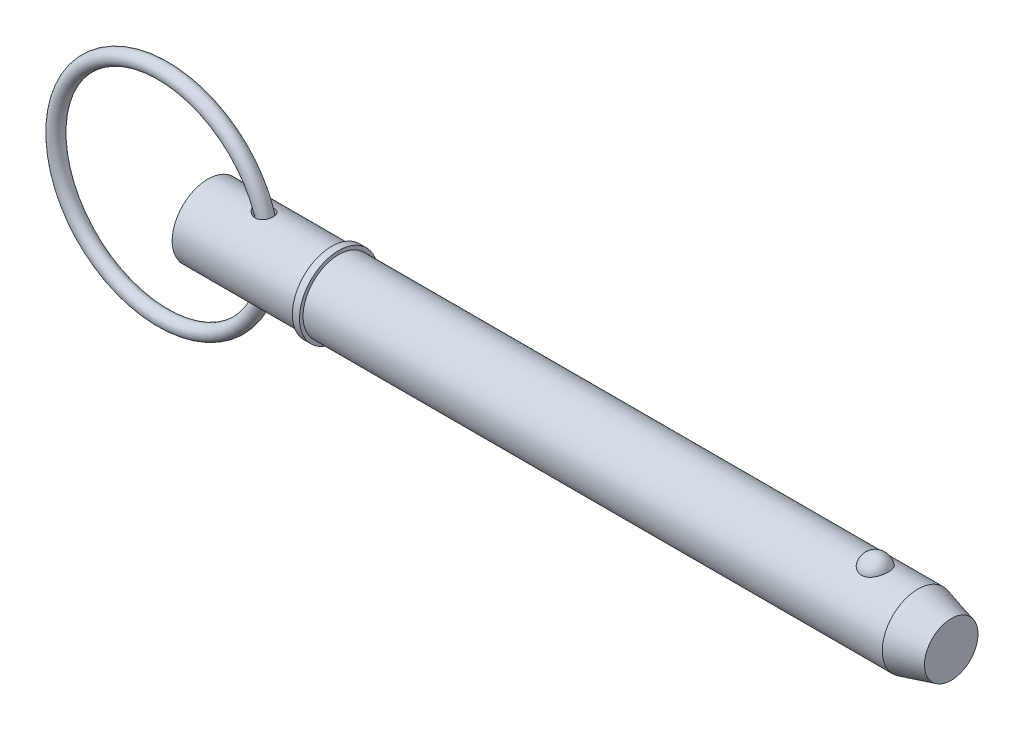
ISO-10303-21;
HEADER;
FILE_DESCRIPTION(('STEP AP214'),'2;1');
FILE_NAME('part.step','',(''),(''),'','','');
FILE_SCHEMA(('AUTOMOTIVE_DESIGN { 1 0 10303 214 1 1 1 1 }'));
ENDSEC;
DATA;
#1=APPLICATION_CONTEXT('core data for automotive mechanical design processes');
#2=APPLICATION_PROTOCOL_DEFINITION('international standard','automotive_design',2000,#1);
#3=PRODUCT_CONTEXT('',#1,'mechanical');
#4=PRODUCT('Part','Part','',(#3));
#5=PRODUCT_RELATED_PRODUCT_CATEGORY('part','',(#4));
#6=PRODUCT_DEFINITION_FORMATION('','',#4);
#7=PRODUCT_DEFINITION_CONTEXT('part definition',#1,'design');
#8=PRODUCT_DEFINITION('design','',#6,#7);
#9=PRODUCT_DEFINITION_SHAPE('','',#8);
#10=(LENGTH_UNIT() NAMED_UNIT(*) SI_UNIT(.MILLI.,.METRE.));
#11=(NAMED_UNIT(*) PLANE_ANGLE_UNIT() SI_UNIT($,.RADIAN.));
#12=(NAMED_UNIT(*) SI_UNIT($,.STERADIAN.) SOLID_ANGLE_UNIT());
#13=UNCERTAINTY_MEASURE_WITH_UNIT(LENGTH_MEASURE(1.E-05),#10,'distance_accuracy_value','');
#14=(GEOMETRIC_REPRESENTATION_CONTEXT(3) GLOBAL_UNCERTAINTY_ASSIGNED_CONTEXT((#13)) GLOBAL_UNIT_ASSIGNED_CONTEXT((#10,
#11,#12)) REPRESENTATION_CONTEXT('',''));
#15=CARTESIAN_POINT('',(0.,0.,0.));
#16=DIRECTION('',(0.,0.,1.));
#17=DIRECTION('',(1.,0.,0.));
#18=AXIS2_PLACEMENT_3D('',#15,#16,#17);
#19=CARTESIAN_POINT('',(-11.9894358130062,0.,0.));
#20=DIRECTION('',(0.,0.,1.));
#21=DIRECTION('',(1.,0.,0.));
#22=AXIS2_PLACEMENT_3D('',#19,#20,#21);
#23=TOROIDAL_SURFACE('',#22,28.575,1.905);
#24=CARTESIAN_POINT('',(18.4905641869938,0.,0.));
#25=VERTEX_POINT('',#24);
#26=VERTEX_LOOP('',#25);
#27=FACE_BOUND('',#26,.T.);
#28=ADVANCED_FACE('P0_F12',(#27),#23,.T.);
#29=CLOSED_SHELL('',(#28));
#30=MANIFOLD_SOLID_BREP('P0_B1',#29);
#31=CARTESIAN_POINT('',(0.,0.,0.));
#32=DIRECTION('',(1.,0.,0.));
#33=DIRECTION('',(0.,0.,-1.));
#34=AXIS2_PLACEMENT_3D('',#31,#32,#33);
#35=CYLINDRICAL_SURFACE('',#34,9.525);
#36=CARTESIAN_POINT('',(12.9513882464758,9.41921920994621,-1.41559473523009));
#37=CARTESIAN_POINT('',(13.0504692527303,9.40163924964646,-1.53256769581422));
#38=CARTESIAN_POINT('',(13.1602600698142,9.38319823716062,-1.6404459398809));
#39=CARTESIAN_POINT('',(13.3966485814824,9.34687220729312,-1.83618480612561));
#40=CARTESIAN_POINT('',(13.5232761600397,9.32898824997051,-1.92400906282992));
#41=CARTESIAN_POINT('',(13.78900694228,9.29593183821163,-2.07784697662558));
#42=CARTESIAN_POINT('',(13.9280753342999,9.28075215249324,-2.14391921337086));
#43=CARTESIAN_POINT('',(14.2153444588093,9.25488828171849,-2.25295850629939));
#44=CARTESIAN_POINT('',(14.3635415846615,9.24420233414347,-2.29593462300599));
#45=CARTESIAN_POINT('',(14.669669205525,9.22859713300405,-2.3579005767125));
#46=CARTESIAN_POINT('',(14.8277567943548,9.22385123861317,-2.37617053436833));
#47=CARTESIAN_POINT('',(15.1447573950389,9.22170813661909,-2.38448481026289));
#48=CARTESIAN_POINT('',(15.3036699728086,9.22430739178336,-2.3745427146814));
#49=CARTESIAN_POINT('',(15.6046561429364,9.2363636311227,-2.32717331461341));
#50=CARTESIAN_POINT('',(15.7470893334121,9.24528216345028,-2.29190131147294));
#51=CARTESIAN_POINT('',(16.0228763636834,9.26842607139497,-2.19642882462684));
#52=CARTESIAN_POINT('',(16.1562346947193,9.28264879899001,-2.1362407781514));
#53=CARTESIAN_POINT('',(16.3991522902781,9.31332263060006,-1.99805318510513));
#54=CARTESIAN_POINT('',(16.5097585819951,9.32951023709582,-1.92182839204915));
#55=CARTESIAN_POINT('',(16.7159974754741,9.36298467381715,-1.75147176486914));
#56=CARTESIAN_POINT('',(16.811631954,9.38027136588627,-1.65734217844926));
#57=CARTESIAN_POINT('',(16.9833240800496,9.41356881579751,-1.45618916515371));
#58=CARTESIAN_POINT('',(17.0597719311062,9.42959946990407,-1.34950141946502));
#59=CARTESIAN_POINT('',(17.1939538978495,9.45905380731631,-1.12462011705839));
#60=CARTESIAN_POINT('',(17.2516877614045,9.4724774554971,-1.00642640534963));
#61=CARTESIAN_POINT('',(17.3474400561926,9.49535683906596,-0.760990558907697));
#62=CARTESIAN_POINT('',(17.3853184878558,9.50478431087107,-0.633691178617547));
#63=CARTESIAN_POINT('',(17.4399027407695,9.51852575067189,-0.374363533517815));
#64=CARTESIAN_POINT('',(17.4566077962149,9.52283953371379,-0.242335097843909));
#65=CARTESIAN_POINT('',(17.4685150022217,9.52590431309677,0.0235692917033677));
#66=CARTESIAN_POINT('',(17.4635842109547,9.52462091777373,0.157451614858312));
#67=CARTESIAN_POINT('',(17.4320243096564,9.5165501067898,0.422467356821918));
#68=CARTESIAN_POINT('',(17.4053947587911,9.50976257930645,0.55360071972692));
#69=CARTESIAN_POINT('',(17.3310009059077,9.49140797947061,0.809490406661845));
#70=CARTESIAN_POINT('',(17.2832204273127,9.47983724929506,0.934241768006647));
#71=CARTESIAN_POINT('',(17.1676219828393,9.453180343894,1.1736825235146));
#72=CARTESIAN_POINT('',(17.0998044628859,9.43809424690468,1.28837214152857));
#73=CARTESIAN_POINT('',(16.9461013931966,9.40614962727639,1.50393386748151));
#74=CARTESIAN_POINT('',(16.8602910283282,9.38929862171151,1.6048606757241));
#75=CARTESIAN_POINT('',(16.6726759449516,9.35566510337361,1.79055313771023));
#76=CARTESIAN_POINT('',(16.5708731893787,9.33888258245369,1.87532077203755));
#77=CARTESIAN_POINT('',(16.3550631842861,9.30741331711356,2.02572386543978));
#78=CARTESIAN_POINT('',(16.2411701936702,9.29270956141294,2.09151983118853));
#79=CARTESIAN_POINT('',(16.0037488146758,9.26681293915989,2.20343355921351));
#80=CARTESIAN_POINT('',(15.8802207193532,9.25561996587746,2.24955191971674));
#81=CARTESIAN_POINT('',(15.6262451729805,9.23779438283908,2.32167613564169));
#82=CARTESIAN_POINT('',(15.4957570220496,9.23119272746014,2.34754561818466));
#83=CARTESIAN_POINT('',(15.2322153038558,9.22318493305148,2.37881082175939));
#84=CARTESIAN_POINT('',(15.0991611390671,9.22178001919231,2.38420171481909));
#85=CARTESIAN_POINT('',(14.8267609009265,9.22414647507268,2.37503099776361));
#86=CARTESIAN_POINT('',(14.6874545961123,9.22819578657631,2.35939810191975));
#87=CARTESIAN_POINT('',(14.412976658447,9.24129253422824,2.30756034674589));
#88=CARTESIAN_POINT('',(14.2778066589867,9.25034191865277,2.27134746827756));
#89=CARTESIAN_POINT('',(14.0027915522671,9.27334688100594,2.1756145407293));
#90=CARTESIAN_POINT('',(13.8635960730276,9.28766658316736,2.11431132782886));
#91=CARTESIAN_POINT('',(13.5969045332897,9.31925368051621,1.97041856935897));
#92=CARTESIAN_POINT('',(13.4694182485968,9.33652350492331,1.88781145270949));
#93=CARTESIAN_POINT('',(13.2243568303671,9.37286659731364,1.69844580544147));
#94=CARTESIAN_POINT('',(13.1075060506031,9.39198626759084,1.59075211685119));
#95=CARTESIAN_POINT('',(12.8957171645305,9.42881110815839,1.35544651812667));
#96=CARTESIAN_POINT('',(12.8007455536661,9.44651841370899,1.22786557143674));
#97=CARTESIAN_POINT('',(12.6580495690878,9.4741137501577,0.9887243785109));
#98=CARTESIAN_POINT('',(12.604453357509,9.4848570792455,0.880756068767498));
#99=CARTESIAN_POINT('',(12.515693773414,9.50295777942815,0.657225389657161));
#100=CARTESIAN_POINT('',(12.4805142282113,9.51031812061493,0.541669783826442));
#101=CARTESIAN_POINT('',(12.4305797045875,9.52083647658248,0.305475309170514));
#102=CARTESIAN_POINT('',(12.4159122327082,9.52397648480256,0.18481691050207));
#103=CARTESIAN_POINT('',(12.408320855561,9.52559626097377,-0.0572308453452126));
#104=CARTESIAN_POINT('',(12.4153963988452,9.52407614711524,-0.178620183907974));
#105=CARTESIAN_POINT('',(12.4495068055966,9.51684301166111,-0.409566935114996));
#106=CARTESIAN_POINT('',(12.4750931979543,9.51143444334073,-0.519353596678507));
#107=CARTESIAN_POINT('',(12.543120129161,9.49733710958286,-0.73328523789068));
#108=CARTESIAN_POINT('',(12.5855568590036,9.4886490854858,-0.837431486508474));
#109=CARTESIAN_POINT('',(12.6780792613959,9.47023833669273,-1.02356028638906));
#110=CARTESIAN_POINT('',(12.7261842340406,9.46084463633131,-1.10657511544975));
#111=CARTESIAN_POINT('',(12.8319313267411,9.44081892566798,-1.26610577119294));
#112=CARTESIAN_POINT('',(12.8895756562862,9.43018662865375,-1.34262008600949));
#113=CARTESIAN_POINT('',(12.9513882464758,9.41921920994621,-1.41559473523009));
#114=B_SPLINE_CURVE_WITH_KNOTS('',3,(#36,#37,#38,#39,#40,#41,#42,#43,#44,#45,#46,#47,#48,#49,
#50,#51,#52,#53,#54,#55,#56,#57,#58,#59,#60,#61,#62,#63,#64,#65,#66,#67,#68,#69,#70,#71,#72,#73,
#74,#75,#76,#77,#78,#79,#80,#81,#82,#83,#84,#85,#86,#87,#88,#89,#90,#91,#92,#93,#94,#95,#96,#97,
#98,#99,#100,#101,#102,#103,#104,#105,#106,#107,#108,#109,#110,#111,#112,#113),.UNSPECIFIED.,
.T.,.F.,(4,2,2,2,2,2,2,2,2,2,2,2,2,2,2,2,2,2,2,2,2,2,2,2,2,2,2,2,2,2,2,2,2,2,2,2,2,2,4),(0.,
0.462524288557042,0.925880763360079,1.3879789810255,1.8498957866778,2.3250010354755,
2.79987752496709,3.23851602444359,3.67693583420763,4.08084875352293,4.48471100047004,
4.87953549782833,5.27436531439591,5.67194282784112,6.0695347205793,6.46957303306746,
6.86961947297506,7.26997240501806,7.67031642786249,8.06901977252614,8.46767421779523,
8.86284969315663,9.25801315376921,9.65581560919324,10.0537118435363,10.4726706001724,
10.8917927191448,11.3481090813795,11.8048030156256,12.2824769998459,12.7594145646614,
13.1209614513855,13.4821903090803,13.8449555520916,14.2077115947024,14.5447865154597,
14.881785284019,15.170268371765,15.4588183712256),.UNSPECIFIED.);
#115=CARTESIAN_POINT('',(12.9513882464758,9.41921920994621,-1.41559473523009));
#116=VERTEX_POINT('',#115);
#117=EDGE_CURVE('P1_E42',#116,#116,#114,.T.);
#118=ORIENTED_EDGE('',*,*,#117,.T.);
#119=EDGE_LOOP('',(#118));
#120=FACE_BOUND('',#119,.T.);
#121=CARTESIAN_POINT('',(0.,0.,0.));
#122=DIRECTION('',(1.,0.,0.));
#123=DIRECTION('',(0.,0.,-1.));
#124=AXIS2_PLACEMENT_3D('',#121,#122,#123);
#125=CIRCLE('',#124,9.525);
#126=CARTESIAN_POINT('',(0.,0.,-9.525));
#127=VERTEX_POINT('',#126);
#128=EDGE_CURVE('P1_E9',#127,#127,#125,.T.);
#129=ORIENTED_EDGE('',*,*,#128,.T.);
#130=EDGE_LOOP('',(#129));
#131=FACE_BOUND('',#130,.T.);
#132=CARTESIAN_POINT('',(33.025,0.,0.));
#133=DIRECTION('',(1.,0.,0.));
#134=DIRECTION('',(0.,0.,-1.));
#135=AXIS2_PLACEMENT_3D('',#132,#133,#134);
#136=CIRCLE('',#135,9.525);
#137=CARTESIAN_POINT('',(33.025,0.,-9.525));
#138=VERTEX_POINT('',#137);
#139=EDGE_CURVE('P1_E25',#138,#138,#136,.T.);
#140=ORIENTED_EDGE('',*,*,#139,.F.);
#141=EDGE_LOOP('',(#140));
#142=FACE_BOUND('',#141,.T.);
#143=CARTESIAN_POINT('',(12.9513882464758,-9.41921920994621,-1.41559473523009));
#144=CARTESIAN_POINT('',(12.8706569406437,-9.43354320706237,-1.32028288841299));
#145=CARTESIAN_POINT('',(12.7970077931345,-9.44729974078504,-1.21890449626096));
#146=CARTESIAN_POINT('',(12.6667099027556,-9.47239055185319,-1.00546491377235));
#147=CARTESIAN_POINT('',(12.6100480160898,-9.48372669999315,-0.893412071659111));
#148=CARTESIAN_POINT('',(12.5163428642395,-9.50281544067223,-0.66020233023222));
#149=CARTESIAN_POINT('',(12.4794216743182,-9.51054569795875,-0.538993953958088));
#150=CARTESIAN_POINT('',(12.4282252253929,-9.52133525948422,-0.29167282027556));
#151=CARTESIAN_POINT('',(12.4139371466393,-9.52439720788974,-0.165562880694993));
#152=CARTESIAN_POINT('',(12.4092595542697,-9.52539668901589,0.0763263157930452));
#153=CARTESIAN_POINT('',(12.4169377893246,-9.5237485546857,0.192070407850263));
#154=CARTESIAN_POINT('',(12.4515961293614,-9.51640070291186,0.420478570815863));
#155=CARTESIAN_POINT('',(12.4785770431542,-9.51070081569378,0.533142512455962));
#156=CARTESIAN_POINT('',(12.5496371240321,-9.49599978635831,0.750537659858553));
#157=CARTESIAN_POINT('',(12.5934215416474,-9.48705569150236,0.855370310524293));
#158=CARTESIAN_POINT('',(12.6960201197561,-9.46670226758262,1.05710432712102));
#159=CARTESIAN_POINT('',(12.754838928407,-9.45529217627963,1.15400322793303));
#160=CARTESIAN_POINT('',(12.8926588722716,-9.42958102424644,1.34883014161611));
#161=CARTESIAN_POINT('',(12.9731843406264,-9.41509922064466,1.44565277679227));
#162=CARTESIAN_POINT('',(13.1473692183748,-9.38554264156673,1.62653953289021));
#163=CARTESIAN_POINT('',(13.2410364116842,-9.37046751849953,1.71059603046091));
#164=CARTESIAN_POINT('',(13.4543924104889,-9.33867330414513,1.87697964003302));
#165=CARTESIAN_POINT('',(13.5758667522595,-9.32205896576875,1.95704323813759));
#166=CARTESIAN_POINT('',(13.8299208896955,-9.29140277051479,2.09777392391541));
#167=CARTESIAN_POINT('',(13.9625074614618,-9.27736250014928,2.15842906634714));
#168=CARTESIAN_POINT('',(14.2477938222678,-9.25234849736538,2.26337318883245));
#169=CARTESIAN_POINT('',(14.4012368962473,-9.2417532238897,2.30575283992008));
#170=CARTESIAN_POINT('',(14.7134258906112,-9.22706044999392,2.36387471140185));
#171=CARTESIAN_POINT('',(14.8721705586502,-9.22296142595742,2.37962317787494));
#172=CARTESIAN_POINT('',(15.1841930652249,-9.22219798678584,2.38258156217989));
#173=CARTESIAN_POINT('',(15.3374581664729,-9.22526675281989,2.37081567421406));
#174=CARTESIAN_POINT('',(15.6390558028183,-9.23821642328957,2.31984408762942));
#175=CARTESIAN_POINT('',(15.7873916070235,-9.24809271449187,2.28065697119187));
#176=CARTESIAN_POINT('',(16.0605055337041,-9.27231045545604,2.17997072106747));
#177=CARTESIAN_POINT('',(16.1861988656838,-9.28616347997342,2.12082794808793));
#178=CARTESIAN_POINT('',(16.4248737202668,-9.31689725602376,1.9814435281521));
#179=CARTESIAN_POINT('',(16.5378583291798,-9.33377726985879,1.90120701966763));
#180=CARTESIAN_POINT('',(16.7424913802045,-9.36766057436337,1.72629138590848));
#181=CARTESIAN_POINT('',(16.8349077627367,-9.38461836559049,1.63249912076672));
#182=CARTESIAN_POINT('',(17.0025959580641,-9.41752009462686,1.43052052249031));
#183=CARTESIAN_POINT('',(17.0778684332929,-9.43346407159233,1.32233474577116));
#184=CARTESIAN_POINT('',(17.2093311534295,-9.46256896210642,1.09477833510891));
#185=CARTESIAN_POINT('',(17.2655443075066,-9.47573320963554,0.975421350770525));
#186=CARTESIAN_POINT('',(17.3577240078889,-9.49788660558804,0.728764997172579));
#187=CARTESIAN_POINT('',(17.3936897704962,-9.5068755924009,0.601465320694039));
#188=CARTESIAN_POINT('',(17.4447894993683,-9.51977728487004,0.341392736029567));
#189=CARTESIAN_POINT('',(17.4597470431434,-9.52364698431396,0.208583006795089));
#190=CARTESIAN_POINT('',(17.467935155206,-9.52575588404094,-0.0577507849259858));
#191=CARTESIAN_POINT('',(17.4611651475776,-9.52399493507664,-0.191274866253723));
#192=CARTESIAN_POINT('',(17.4259933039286,-9.51501704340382,-0.455658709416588));
#193=CARTESIAN_POINT('',(17.3975278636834,-9.50778405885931,-0.586509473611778));
#194=CARTESIAN_POINT('',(17.3195245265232,-9.48862442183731,-0.841413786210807));
#195=CARTESIAN_POINT('',(17.2699864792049,-9.47669773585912,-0.965467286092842));
#196=CARTESIAN_POINT('',(17.1510794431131,-9.44947793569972,-1.20302860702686));
#197=CARTESIAN_POINT('',(17.0817421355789,-9.43419020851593,-1.31655289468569));
#198=CARTESIAN_POINT('',(16.9249035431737,-9.40193593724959,-1.52999797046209));
#199=CARTESIAN_POINT('',(16.8374037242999,-9.38496952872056,-1.62991985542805));
#200=CARTESIAN_POINT('',(16.6472525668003,-9.35139745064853,-1.81261591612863));
#201=CARTESIAN_POINT('',(16.544718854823,-9.33479003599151,-1.89551219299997));
#202=CARTESIAN_POINT('',(16.3268885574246,-9.30366076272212,-2.04284430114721));
#203=CARTESIAN_POINT('',(16.2115933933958,-9.28913867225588,-2.10728218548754));
#204=CARTESIAN_POINT('',(15.9721327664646,-9.26380878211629,-2.21598517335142));
#205=CARTESIAN_POINT('',(15.8480095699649,-9.25298455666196,-2.26033977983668));
#206=CARTESIAN_POINT('',(15.5939970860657,-9.23601616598,-2.32870721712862));
#207=CARTESIAN_POINT('',(15.4641070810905,-9.22987258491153,-2.35271750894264));
#208=CARTESIAN_POINT('',(15.1982340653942,-9.22261892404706,-2.38099747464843));
#209=CARTESIAN_POINT('',(15.0621840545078,-9.22166165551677,-2.38466791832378));
#210=CARTESIAN_POINT('',(14.7911713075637,-9.22504733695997,-2.37153091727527));
#211=CARTESIAN_POINT('',(14.6562088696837,-9.2293916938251,-2.35471803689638));
#212=CARTESIAN_POINT('',(14.3799999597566,-9.24325361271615,-2.29972931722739));
#213=CARTESIAN_POINT('',(14.2390842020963,-9.25314817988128,-2.2599897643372));
#214=CARTESIAN_POINT('',(13.9651910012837,-9.27709186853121,-2.15959208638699));
#215=CARTESIAN_POINT('',(13.8322212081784,-9.29114491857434,-2.09891417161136));
#216=CARTESIAN_POINT('',(13.5621642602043,-9.32369066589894,-1.94960068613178));
#217=CARTESIAN_POINT('',(13.4264724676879,-9.34251276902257,-1.85849626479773));
#218=CARTESIAN_POINT('',(13.1736579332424,-9.38095091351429,-1.6535412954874));
#219=CARTESIAN_POINT('',(13.0565182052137,-9.40056620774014,-1.53971177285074));
#220=CARTESIAN_POINT('',(12.9513882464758,-9.41921920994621,-1.41559473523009));
#221=B_SPLINE_CURVE_WITH_KNOTS('',3,(#143,#144,#145,#146,#147,#148,#149,#150,#151,#152,#153,
#154,#155,#156,#157,#158,#159,#160,#161,#162,#163,#164,#165,#166,#167,#168,#169,#170,#171,#172,
#173,#174,#175,#176,#177,#178,#179,#180,#181,#182,#183,#184,#185,#186,#187,#188,#189,#190,#191,
#192,#193,#194,#195,#196,#197,#198,#199,#200,#201,#202,#203,#204,#205,#206,#207,#208,#209,#210,
#211,#212,#213,#214,#215,#216,#217,#218,#219,#220),.UNSPECIFIED.,.T.,.F.,(4,2,2,2,2,2,2,2,2,2,2,
2,2,2,2,2,2,2,2,2,2,2,2,2,2,2,2,2,2,2,2,2,2,2,2,2,2,2,4),(0.,0.376746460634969,0.75320065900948,
1.13195666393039,1.51049805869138,1.85679105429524,2.20309856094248,2.54359033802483,
2.88418751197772,3.26301611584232,3.64207005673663,4.07954912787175,4.51729693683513,
4.99355673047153,5.46970480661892,5.92841231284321,6.38680927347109,6.80346940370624,
7.22002812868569,7.61642768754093,8.01281192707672,8.40871801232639,8.80463942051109,
9.20386620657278,9.60310357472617,10.0035159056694,10.4039310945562,10.8037091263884,
11.2034549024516,11.6002252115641,11.9969513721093,12.3918916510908,12.7868812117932,
13.1934480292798,13.6001227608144,14.038511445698,14.4773156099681,14.9683748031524,
15.4589817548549),.UNSPECIFIED.);
#222=CARTESIAN_POINT('',(12.9513882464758,-9.41921920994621,-1.41559473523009));
#223=VERTEX_POINT('',#222);
#224=EDGE_CURVE('P1_E17',#223,#223,#221,.T.);
#225=ORIENTED_EDGE('',*,*,#224,.T.);
#226=EDGE_LOOP('',(#225));
#227=FACE_BOUND('',#226,.T.);
#228=ADVANCED_FACE('P1_F13',(#120,#131,#142,#227),#35,.T.);
#229=CARTESIAN_POINT('',(0.,0.,0.));
#230=DIRECTION('',(1.,0.,0.));
#231=DIRECTION('',(0.,0.,-1.));
#232=AXIS2_PLACEMENT_3D('',#229,#230,#231);
#233=CYLINDRICAL_SURFACE('',#232,9.525);
#234=CARTESIAN_POINT('',(189.543054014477,0.,0.));
#235=DIRECTION('',(1.,0.,0.));
#236=DIRECTION('',(0.,0.,-1.));
#237=AXIS2_PLACEMENT_3D('',#234,#235,#236);
#238=CIRCLE('',#237,9.525);
#239=CARTESIAN_POINT('',(189.543054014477,0.,-9.525));
#240=VERTEX_POINT('',#239);
#241=EDGE_CURVE('P1_E99',#240,#240,#238,.T.);
#242=ORIENTED_EDGE('',*,*,#241,.F.);
#243=EDGE_LOOP('',(#242));
#244=FACE_BOUND('',#243,.T.);
#245=CARTESIAN_POINT('',(34.93,0.,0.));
#246=DIRECTION('',(1.,0.,0.));
#247=DIRECTION('',(0.,0.,-1.));
#248=AXIS2_PLACEMENT_3D('',#245,#246,#247);
#249=CIRCLE('',#248,9.525);
#250=CARTESIAN_POINT('',(34.93,0.,-9.525));
#251=VERTEX_POINT('',#250);
#252=EDGE_CURVE('P1_E96',#251,#251,#249,.T.);
#253=ORIENTED_EDGE('',*,*,#252,.T.);
#254=EDGE_LOOP('',(#253));
#255=FACE_BOUND('',#254,.T.);
#256=CARTESIAN_POINT('',(178.145757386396,8.80405803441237,3.63513233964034));
#257=CARTESIAN_POINT('',(178.051676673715,8.80405953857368,3.63513053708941));
#258=CARTESIAN_POINT('',(177.957561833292,8.80561325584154,3.63137461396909));
#259=CARTESIAN_POINT('',(177.770012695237,8.81177748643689,3.61638665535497));
#260=CARTESIAN_POINT('',(177.676578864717,8.81638992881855,3.60514990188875));
#261=CARTESIAN_POINT('',(177.397945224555,8.83467114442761,3.56024627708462));
#262=CARTESIAN_POINT('',(177.214691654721,8.85278327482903,3.51538626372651));
#263=CARTESIAN_POINT('',(176.859509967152,8.89871214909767,3.39742145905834));
#264=CARTESIAN_POINT('',(176.687553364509,8.92650327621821,3.32439116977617));
#265=CARTESIAN_POINT('',(176.358707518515,8.98874819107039,3.15220244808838));
#266=CARTESIAN_POINT('',(176.201811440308,9.02319893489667,3.05305594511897));
#267=CARTESIAN_POINT('',(175.902214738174,9.09629186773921,2.82797815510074));
#268=CARTESIAN_POINT('',(175.760060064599,9.13502685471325,2.70135138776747));
#269=CARTESIAN_POINT('',(175.498299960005,9.21186572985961,2.42641932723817));
#270=CARTESIAN_POINT('',(175.378701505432,9.24996941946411,2.27810735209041));
#271=CARTESIAN_POINT('',(175.159645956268,9.32341082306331,1.95652290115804));
#272=CARTESIAN_POINT('',(175.061317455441,9.35855090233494,1.78243511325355));
#273=CARTESIAN_POINT('',(174.893819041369,9.42045142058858,1.419372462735));
#274=CARTESIAN_POINT('',(174.824651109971,9.44721128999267,1.23039658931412));
#275=CARTESIAN_POINT('',(174.716199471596,9.48990641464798,0.840370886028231));
#276=CARTESIAN_POINT('',(174.677288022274,9.50570658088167,0.639202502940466));
#277=CARTESIAN_POINT('',(174.631555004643,9.52433146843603,0.232664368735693));
#278=CARTESIAN_POINT('',(174.624732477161,9.52715657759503,0.0272947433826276));
#279=CARTESIAN_POINT('',(174.643255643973,9.51956918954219,-0.380478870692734));
#280=CARTESIAN_POINT('',(174.668405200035,9.50923740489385,-0.582893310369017));
#281=CARTESIAN_POINT('',(174.75002537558,9.47651897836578,-0.980293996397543));
#282=CARTESIAN_POINT('',(174.806496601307,9.45413210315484,-1.17528009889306));
#283=CARTESIAN_POINT('',(174.949719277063,9.39954044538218,-1.55263697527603));
#284=CARTESIAN_POINT('',(175.036512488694,9.36732213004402,-1.73498993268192));
#285=CARTESIAN_POINT('',(175.238610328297,9.29640700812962,-2.08177763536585));
#286=CARTESIAN_POINT('',(175.353917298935,9.25770966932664,-2.24621090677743));
#287=CARTESIAN_POINT('',(175.611264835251,9.17775604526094,-2.55338333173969));
#288=CARTESIAN_POINT('',(175.753434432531,9.136488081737,-2.69601150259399));
#289=CARTESIAN_POINT('',(176.06089985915,9.05620497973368,-2.95451229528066));
#290=CARTESIAN_POINT('',(176.226193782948,9.01718965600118,-3.070387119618));
#291=CARTESIAN_POINT('',(176.572052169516,8.94680019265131,-3.26976836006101));
#292=CARTESIAN_POINT('',(176.752227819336,8.91528408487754,-3.35389750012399));
#293=CARTESIAN_POINT('',(177.125651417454,8.86272514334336,-3.49043503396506));
#294=CARTESIAN_POINT('',(177.318894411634,8.84167836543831,-3.54285537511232));
#295=CARTESIAN_POINT('',(177.702503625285,8.81348056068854,-3.61241306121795));
#296=CARTESIAN_POINT('',(177.892525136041,8.80568348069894,-3.6311933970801));
#297=CARTESIAN_POINT('',(178.273190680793,8.80289410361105,-3.63795342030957));
#298=CARTESIAN_POINT('',(178.463834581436,8.80789922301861,-3.62593932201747));
#299=CARTESIAN_POINT('',(178.834007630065,8.82974915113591,-3.57238430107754));
#300=CARTESIAN_POINT('',(179.013697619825,8.84621463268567,-3.53178890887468));
#301=CARTESIAN_POINT('',(179.363422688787,8.88875330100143,-3.42331083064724));
#302=CARTESIAN_POINT('',(179.533456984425,8.91482726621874,-3.35542593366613));
#303=CARTESIAN_POINT('',(179.863237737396,8.97448239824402,-3.19248225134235));
#304=CARTESIAN_POINT('',(180.022680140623,9.00821446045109,-3.0968647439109));
#305=CARTESIAN_POINT('',(180.323513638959,9.07935398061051,-2.88162736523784));
#306=CARTESIAN_POINT('',(180.464900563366,9.11676228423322,-2.76200196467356));
#307=CARTESIAN_POINT('',(180.73331931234,9.19347419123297,-2.49516285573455));
#308=CARTESIAN_POINT('',(180.859275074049,9.23277872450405,-2.34686614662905));
#309=CARTESIAN_POINT('',(181.085522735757,9.3073761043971,-2.03093683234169));
#310=CARTESIAN_POINT('',(181.18581004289,9.34266823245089,-1.86330077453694));
#311=CARTESIAN_POINT('',(181.361514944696,9.40674710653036,-1.50744893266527));
#312=CARTESIAN_POINT('',(181.436041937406,9.43529176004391,-1.31874876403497));
#313=CARTESIAN_POINT('',(181.55416505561,9.48144132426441,-0.930631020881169));
#314=CARTESIAN_POINT('',(181.597760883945,9.49904612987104,-0.731213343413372));
#315=CARTESIAN_POINT('',(181.653158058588,9.5215314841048,-0.327147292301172));
#316=CARTESIAN_POINT('',(181.664935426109,9.52640243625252,-0.122495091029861));
#317=CARTESIAN_POINT('',(181.656382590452,9.5228957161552,0.28601848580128));
#318=CARTESIAN_POINT('',(181.63605305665,9.5145183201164,0.489879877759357));
#319=CARTESIAN_POINT('',(181.563884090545,9.48544083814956,0.889994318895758));
#320=CARTESIAN_POINT('',(181.512199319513,9.46480124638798,1.08627971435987));
#321=CARTESIAN_POINT('',(181.378491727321,9.4133389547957,1.46682086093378));
#322=CARTESIAN_POINT('',(181.296466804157,9.38251554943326,1.65107577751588));
#323=CARTESIAN_POINT('',(181.10319292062,9.31365636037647,2.00346348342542));
#324=CARTESIAN_POINT('',(180.991783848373,9.27558138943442,2.17150083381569));
#325=CARTESIAN_POINT('',(180.742294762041,9.19638714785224,2.4856311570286));
#326=CARTESIAN_POINT('',(180.604216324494,9.15526805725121,2.63172542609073));
#327=CARTESIAN_POINT('',(180.304843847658,9.07465393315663,2.89750997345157));
#328=CARTESIAN_POINT('',(180.143610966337,9.03515496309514,3.01726776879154));
#329=CARTESIAN_POINT('',(179.801613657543,8.96227564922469,3.22732920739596));
#330=CARTESIAN_POINT('',(179.620841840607,8.92889763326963,3.31762165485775));
#331=CARTESIAN_POINT('',(179.251445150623,8.8734538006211,3.46314419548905));
#332=CARTESIAN_POINT('',(179.06332371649,8.85102983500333,3.51950082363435));
#333=CARTESIAN_POINT('',(178.77578699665,8.82666967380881,3.57993683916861));
#334=CARTESIAN_POINT('',(178.679133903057,8.82009725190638,3.5960621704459));
#335=CARTESIAN_POINT('',(178.484677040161,8.81020897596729,3.62022512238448));
#336=CARTESIAN_POINT('',(178.38687410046,8.80689090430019,3.62826825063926));
#337=CARTESIAN_POINT('',(178.241224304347,8.80445615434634,3.63416760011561));
#338=CARTESIAN_POINT('',(178.193495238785,8.80405727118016,3.63513325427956));
#339=CARTESIAN_POINT('',(178.145757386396,8.80405803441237,3.63513233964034));
#340=B_SPLINE_CURVE_WITH_KNOTS('',3,(#256,#257,#258,#259,#260,#261,#262,#263,#264,#265,#266,
#267,#268,#269,#270,#271,#272,#273,#274,#275,#276,#277,#278,#279,#280,#281,#282,#283,#284,#285,
#286,#287,#288,#289,#290,#291,#292,#293,#294,#295,#296,#297,#298,#299,#300,#301,#302,#303,#304,
#305,#306,#307,#308,#309,#310,#311,#312,#313,#314,#315,#316,#317,#318,#319,#320,#321,#322,#323,
#324,#325,#326,#327,#328,#329,#330,#331,#332,#333,#334,#335,#336,#337,#338,#339),.UNSPECIFIED.,
.T.,.F.,(4,2,2,2,2,2,2,2,2,2,2,2,2,2,2,2,2,2,2,2,2,2,2,2,2,2,2,2,2,2,2,2,2,2,2,2,2,2,2,2,2,4),
(0.,0.282202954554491,0.564584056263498,1.13017050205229,1.69427128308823,2.25811483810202,
2.83836627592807,3.41879688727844,4.02497117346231,4.63118665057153,5.24474754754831,
5.85829010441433,6.46808687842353,7.07789545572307,7.6885472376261,8.299249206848,
8.91296283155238,9.52662591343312,10.1275338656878,10.7282152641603,11.2986646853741,
11.8689989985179,12.4213015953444,12.973648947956,13.5380053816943,14.1024919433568,
14.695298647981,15.2882113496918,15.8999469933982,16.5116885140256,17.1238909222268,
17.7360805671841,18.3452748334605,18.9545113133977,19.567138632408,20.179729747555,
20.7907316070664,21.4019653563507,21.9915938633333,22.2859053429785,22.5800161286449,
22.7232098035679),.UNSPECIFIED.);
#341=CARTESIAN_POINT('',(178.145757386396,8.80405803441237,3.63513233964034));
#342=VERTEX_POINT('',#341);
#343=EDGE_CURVE('P1_E34',#342,#342,#340,.T.);
#344=ORIENTED_EDGE('',*,*,#343,.T.);
#345=EDGE_LOOP('',(#344));
#346=FACE_BOUND('',#345,.T.);
#347=ADVANCED_FACE('P1_F46',(#244,#255,#346),#233,.T.);
#348=CARTESIAN_POINT('',(0.,0.,0.));
#349=DIRECTION('',(-1.,0.,0.));
#350=DIRECTION('',(0.,0.,1.));
#351=AXIS2_PLACEMENT_3D('',#348,#349,#350);
#352=PLANE('',#351);
#353=ORIENTED_EDGE('',*,*,#128,.F.);
#354=EDGE_LOOP('',(#353));
#355=FACE_BOUND('',#354,.T.);
#356=ADVANCED_FACE('P1_F15',(#355),#352,.T.);
#357=CARTESIAN_POINT('',(33.025,9.525,0.));
#358=DIRECTION('',(-1.,0.,0.));
#359=DIRECTION('',(0.,0.,1.));
#360=AXIS2_PLACEMENT_3D('',#357,#358,#359);
#361=PLANE('',#360);
#362=ORIENTED_EDGE('',*,*,#139,.T.);
#363=EDGE_LOOP('',(#362));
#364=FACE_BOUND('',#363,.T.);
#365=CARTESIAN_POINT('',(33.025,0.,0.));
#366=DIRECTION('',(1.,0.,0.));
#367=DIRECTION('',(0.,0.,-1.));
#368=AXIS2_PLACEMENT_3D('',#365,#366,#367);
#369=CIRCLE('',#368,10.4775);
#370=CARTESIAN_POINT('',(33.025,0.,-10.4775));
#371=VERTEX_POINT('',#370);
#372=EDGE_CURVE('P1_E30',#371,#371,#369,.T.);
#373=ORIENTED_EDGE('',*,*,#372,.F.);
#374=EDGE_LOOP('',(#373));
#375=FACE_BOUND('',#374,.T.);
#376=ADVANCED_FACE('P1_F81',(#364,#375),#361,.T.);
#377=CARTESIAN_POINT('',(0.,0.,0.));
#378=DIRECTION('',(1.,0.,0.));
#379=DIRECTION('',(0.,0.,-1.));
#380=AXIS2_PLACEMENT_3D('',#377,#378,#379);
#381=CYLINDRICAL_SURFACE('',#380,10.4775);
#382=ORIENTED_EDGE('',*,*,#372,.T.);
#383=EDGE_LOOP('',(#382));
#384=FACE_BOUND('',#383,.T.);
#385=CARTESIAN_POINT('',(34.93,0.,0.));
#386=DIRECTION('',(1.,0.,0.));
#387=DIRECTION('',(0.,0.,-1.));
#388=AXIS2_PLACEMENT_3D('',#385,#386,#387);
#389=CIRCLE('',#388,10.4775);
#390=CARTESIAN_POINT('',(34.93,0.,-10.4775));
#391=VERTEX_POINT('',#390);
#392=EDGE_CURVE('P1_E95',#391,#391,#389,.T.);
#393=ORIENTED_EDGE('',*,*,#392,.F.);
#394=EDGE_LOOP('',(#393));
#395=FACE_BOUND('',#394,.T.);
#396=ADVANCED_FACE('P1_F68',(#384,#395),#381,.T.);
#397=CARTESIAN_POINT('',(34.93,10.4775,0.));
#398=DIRECTION('',(1.,0.,0.));
#399=DIRECTION('',(0.,0.,-1.));
#400=AXIS2_PLACEMENT_3D('',#397,#398,#399);
#401=PLANE('',#400);
#402=ORIENTED_EDGE('',*,*,#392,.T.);
#403=EDGE_LOOP('',(#402));
#404=FACE_BOUND('',#403,.T.);
#405=ORIENTED_EDGE('',*,*,#252,.F.);
#406=EDGE_LOOP('',(#405));
#407=FACE_BOUND('',#406,.T.);
#408=ADVANCED_FACE('P1_F62',(#404,#407),#401,.T.);
#409=CARTESIAN_POINT('',(198.43,0.,0.));
#410=DIRECTION('',(-1.,0.,0.));
#411=DIRECTION('',(0.,0.,1.));
#412=AXIS2_PLACEMENT_3D('',#409,#410,#411);
#413=CONICAL_SURFACE('',#412,7.14375000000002,0.26179938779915);
#414=ORIENTED_EDGE('',*,*,#241,.T.);
#415=EDGE_LOOP('',(#414));
#416=FACE_BOUND('',#415,.T.);
#417=CARTESIAN_POINT('',(198.43,0.,0.));
#418=DIRECTION('',(1.,0.,0.));
#419=DIRECTION('',(0.,0.,-1.));
#420=AXIS2_PLACEMENT_3D('',#417,#418,#419);
#421=CIRCLE('',#420,7.14375000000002);
#422=CARTESIAN_POINT('',(198.43,0.,-7.14375000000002));
#423=VERTEX_POINT('',#422);
#424=EDGE_CURVE('P1_E41',#423,#423,#421,.T.);
#425=ORIENTED_EDGE('',*,*,#424,.F.);
#426=EDGE_LOOP('',(#425));
#427=FACE_BOUND('',#426,.T.);
#428=ADVANCED_FACE('P1_F59',(#416,#427),#413,.T.);
#429=CARTESIAN_POINT('',(198.43,7.14375000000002,0.));
#430=DIRECTION('',(1.,0.,0.));
#431=DIRECTION('',(0.,0.,-1.));
#432=AXIS2_PLACEMENT_3D('',#429,#430,#431);
#433=PLANE('',#432);
#434=ORIENTED_EDGE('',*,*,#424,.T.);
#435=EDGE_LOOP('',(#434));
#436=FACE_BOUND('',#435,.T.);
#437=ADVANCED_FACE('P1_F55',(#436),#433,.T.);
#438=CARTESIAN_POINT('',(178.145757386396,8.5725,0.));
#439=DIRECTION('',(-1.,0.,0.));
#440=DIRECTION('',(0.,-1.,0.));
#441=AXIS2_PLACEMENT_3D('',#438,#439,#440);
#442=SPHERICAL_SURFACE('',#441,3.64249999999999);
#443=ORIENTED_EDGE('',*,*,#343,.F.);
#444=EDGE_LOOP('',(#443));
#445=FACE_BOUND('',#444,.T.);
#446=ADVANCED_FACE('P1_F50',(#445),#442,.T.);
#447=CARTESIAN_POINT('',(-11.9894358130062,0.,0.));
#448=DIRECTION('',(0.,0.,1.));
#449=DIRECTION('',(1.,0.,0.));
#450=AXIS2_PLACEMENT_3D('',#447,#448,#449);
#451=TOROIDAL_SURFACE('',#450,28.575,2.38125);
#452=ORIENTED_EDGE('',*,*,#224,.F.);
#453=EDGE_LOOP('',(#452));
#454=FACE_BOUND('',#453,.T.);
#455=ORIENTED_EDGE('',*,*,#117,.F.);
#456=EDGE_LOOP('',(#455));
#457=FACE_BOUND('',#456,.T.);
#458=ADVANCED_FACE('P1_F54',(#454,#457),#451,.F.);
#459=CLOSED_SHELL('',(#228,#347,#356,#376,#396,#408,#428,#437,#446,#458));
#460=MANIFOLD_SOLID_BREP('P1_B1',#459);
#461=ADVANCED_BREP_SHAPE_REPRESENTATION('',(#18,#30,#460),#14);
#462=SHAPE_DEFINITION_REPRESENTATION(#9,#461);
ENDSEC;
END-ISO-10303-21;
